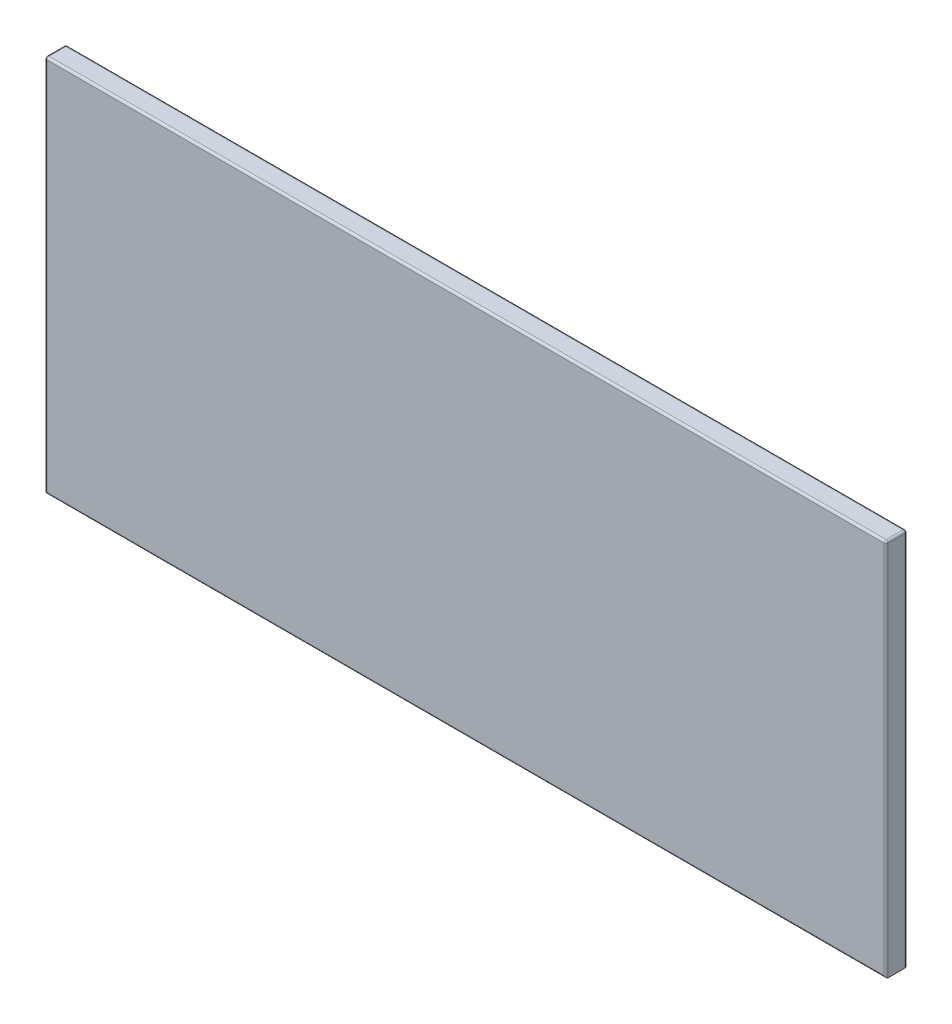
ISO-10303-21;
HEADER;
FILE_DESCRIPTION(('STEP AP214'),'2;1');
FILE_NAME('part.step','',(''),(''),'','','');
FILE_SCHEMA(('AUTOMOTIVE_DESIGN { 1 0 10303 214 1 1 1 1 }'));
ENDSEC;
DATA;
#1=APPLICATION_CONTEXT('core data for automotive mechanical design processes');
#2=APPLICATION_PROTOCOL_DEFINITION('international standard','automotive_design',2000,#1);
#3=PRODUCT_CONTEXT('',#1,'mechanical');
#4=PRODUCT('Part','Part','',(#3));
#5=PRODUCT_RELATED_PRODUCT_CATEGORY('part','',(#4));
#6=PRODUCT_DEFINITION_FORMATION('','',#4);
#7=PRODUCT_DEFINITION_CONTEXT('part definition',#1,'design');
#8=PRODUCT_DEFINITION('design','',#6,#7);
#9=PRODUCT_DEFINITION_SHAPE('','',#8);
#10=(LENGTH_UNIT() NAMED_UNIT(*) SI_UNIT(.MILLI.,.METRE.));
#11=(NAMED_UNIT(*) PLANE_ANGLE_UNIT() SI_UNIT($,.RADIAN.));
#12=(NAMED_UNIT(*) SI_UNIT($,.STERADIAN.) SOLID_ANGLE_UNIT());
#13=UNCERTAINTY_MEASURE_WITH_UNIT(LENGTH_MEASURE(1.E-05),#10,'distance_accuracy_value','');
#14=(GEOMETRIC_REPRESENTATION_CONTEXT(3) GLOBAL_UNCERTAINTY_ASSIGNED_CONTEXT((#13)) GLOBAL_UNIT_ASSIGNED_CONTEXT((#10,
#11,#12)) REPRESENTATION_CONTEXT('',''));
#15=CARTESIAN_POINT('',(0.,0.,0.));
#16=DIRECTION('',(0.,0.,1.));
#17=DIRECTION('',(1.,0.,0.));
#18=AXIS2_PLACEMENT_3D('',#15,#16,#17);
#19=CARTESIAN_POINT('',(-464.655290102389,-37.0452787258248,25.4));
#20=DIRECTION('',(1.,0.,0.));
#21=DIRECTION('',(0.,0.,-1.));
#22=AXIS2_PLACEMENT_3D('',#19,#20,#21);
#23=PLANE('',#22);
#24=DIRECTION('',(0.,0.,-1.));
#25=VECTOR('',#24,1.);
#26=CARTESIAN_POINT('',(-464.655290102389,417.614721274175,25.4));
#27=LINE('',#26,#25);
#28=CARTESIAN_POINT('',(-464.655290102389,417.614721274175,22.86));
#29=VERTEX_POINT('',#28);
#30=CARTESIAN_POINT('',(-464.655290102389,417.614721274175,2.54));
#31=VERTEX_POINT('',#30);
#32=EDGE_CURVE('E203',#29,#31,#27,.T.);
#33=ORIENTED_EDGE('',*,*,#32,.T.);
#34=DIRECTION('',(0.,-1.,0.));
#35=VECTOR('',#34,1.);
#36=CARTESIAN_POINT('',(-464.655290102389,-37.0452787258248,2.54));
#37=LINE('',#36,#35);
#38=CARTESIAN_POINT('',(-464.655290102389,-37.0452787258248,2.54));
#39=VERTEX_POINT('',#38);
#40=EDGE_CURVE('E199',#31,#39,#37,.T.);
#41=ORIENTED_EDGE('',*,*,#40,.T.);
#42=DIRECTION('',(0.,0.,-1.));
#43=VECTOR('',#42,1.);
#44=CARTESIAN_POINT('',(-464.655290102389,-37.0452787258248,25.4));
#45=LINE('',#44,#43);
#46=CARTESIAN_POINT('',(-464.655290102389,-37.0452787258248,22.86));
#47=VERTEX_POINT('',#46);
#48=EDGE_CURVE('E136',#47,#39,#45,.T.);
#49=ORIENTED_EDGE('',*,*,#48,.F.);
#50=DIRECTION('',(0.,-1.,0.));
#51=VECTOR('',#50,1.);
#52=CARTESIAN_POINT('',(-464.655290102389,-37.0452787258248,22.86));
#53=LINE('',#52,#51);
#54=EDGE_CURVE('E201',#47,#29,#53,.F.);
#55=ORIENTED_EDGE('',*,*,#54,.T.);
#56=EDGE_LOOP('',(#33,#41,#49,#55));
#57=FACE_BOUND('',#56,.T.);
#58=ADVANCED_FACE('F39',(#57),#23,.F.);
#59=CARTESIAN_POINT('',(-464.655290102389,-37.0452787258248,25.4));
#60=DIRECTION('',(0.,1.,0.));
#61=DIRECTION('',(0.,0.,1.));
#62=AXIS2_PLACEMENT_3D('',#59,#60,#61);
#63=PLANE('',#62);
#64=ORIENTED_EDGE('',*,*,#48,.T.);
#65=DIRECTION('',(1.,0.,0.));
#66=VECTOR('',#65,1.);
#67=CARTESIAN_POINT('',(551.344709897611,-37.0452787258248,2.54));
#68=LINE('',#67,#66);
#69=CARTESIAN_POINT('',(551.344709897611,-37.0452787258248,2.54));
#70=VERTEX_POINT('',#69);
#71=EDGE_CURVE('E135',#39,#70,#68,.T.);
#72=ORIENTED_EDGE('',*,*,#71,.T.);
#73=DIRECTION('',(0.,0.,-1.));
#74=VECTOR('',#73,1.);
#75=CARTESIAN_POINT('',(551.344709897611,-37.0452787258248,25.4));
#76=LINE('',#75,#74);
#77=CARTESIAN_POINT('',(551.344709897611,-37.0452787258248,22.86));
#78=VERTEX_POINT('',#77);
#79=EDGE_CURVE('E118',#78,#70,#76,.T.);
#80=ORIENTED_EDGE('',*,*,#79,.F.);
#81=DIRECTION('',(1.,0.,0.));
#82=VECTOR('',#81,1.);
#83=CARTESIAN_POINT('',(-464.655290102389,-37.0452787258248,22.86));
#84=LINE('',#83,#82);
#85=EDGE_CURVE('E132',#78,#47,#84,.F.);
#86=ORIENTED_EDGE('',*,*,#85,.T.);
#87=EDGE_LOOP('',(#64,#72,#80,#86));
#88=FACE_BOUND('',#87,.T.);
#89=ADVANCED_FACE('F131',(#88),#63,.F.);
#90=CARTESIAN_POINT('',(551.344709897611,-37.0452787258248,25.4));
#91=DIRECTION('',(-1.,0.,0.));
#92=DIRECTION('',(0.,0.,1.));
#93=AXIS2_PLACEMENT_3D('',#90,#91,#92);
#94=PLANE('',#93);
#95=ORIENTED_EDGE('',*,*,#79,.T.);
#96=DIRECTION('',(0.,1.,0.));
#97=VECTOR('',#96,1.);
#98=CARTESIAN_POINT('',(551.344709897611,420.154721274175,2.54));
#99=LINE('',#98,#97);
#100=CARTESIAN_POINT('',(551.344709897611,417.614721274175,2.54));
#101=VERTEX_POINT('',#100);
#102=EDGE_CURVE('E125',#70,#101,#99,.T.);
#103=ORIENTED_EDGE('',*,*,#102,.T.);
#104=DIRECTION('',(0.,0.,-1.));
#105=VECTOR('',#104,1.);
#106=CARTESIAN_POINT('',(551.344709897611,417.614721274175,25.4));
#107=LINE('',#106,#105);
#108=CARTESIAN_POINT('',(551.344709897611,417.614721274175,22.86));
#109=VERTEX_POINT('',#108);
#110=EDGE_CURVE('E120',#101,#109,#107,.F.);
#111=ORIENTED_EDGE('',*,*,#110,.T.);
#112=DIRECTION('',(0.,1.,0.));
#113=VECTOR('',#112,1.);
#114=CARTESIAN_POINT('',(551.344709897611,-37.0452787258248,22.86));
#115=LINE('',#114,#113);
#116=EDGE_CURVE('E115',#109,#78,#115,.F.);
#117=ORIENTED_EDGE('',*,*,#116,.T.);
#118=EDGE_LOOP('',(#95,#103,#111,#117));
#119=FACE_BOUND('',#118,.T.);
#120=ADVANCED_FACE('F117',(#119),#94,.F.);
#121=CARTESIAN_POINT('',(-464.655290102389,420.154721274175,25.4));
#122=DIRECTION('',(0.,-1.,0.));
#123=DIRECTION('',(0.,0.,-1.));
#124=AXIS2_PLACEMENT_3D('',#121,#122,#123);
#125=PLANE('',#124);
#126=DIRECTION('',(-1.,0.,0.));
#127=VECTOR('',#126,1.);
#128=CARTESIAN_POINT('',(-464.655290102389,420.154721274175,22.86));
#129=LINE('',#128,#127);
#130=CARTESIAN_POINT('',(-462.115290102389,420.154721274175,22.86));
#131=VERTEX_POINT('',#130);
#132=CARTESIAN_POINT('',(548.804709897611,420.154721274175,22.86));
#133=VERTEX_POINT('',#132);
#134=EDGE_CURVE('E48',#131,#133,#129,.F.);
#135=ORIENTED_EDGE('',*,*,#134,.T.);
#136=DIRECTION('',(0.,0.,-1.));
#137=VECTOR('',#136,1.);
#138=CARTESIAN_POINT('',(548.804709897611,420.154721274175,25.4));
#139=LINE('',#138,#137);
#140=CARTESIAN_POINT('',(548.804709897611,420.154721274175,2.54));
#141=VERTEX_POINT('',#140);
#142=EDGE_CURVE('E11',#133,#141,#139,.T.);
#143=ORIENTED_EDGE('',*,*,#142,.T.);
#144=DIRECTION('',(-1.,0.,0.));
#145=VECTOR('',#144,1.);
#146=CARTESIAN_POINT('',(-464.655290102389,420.154721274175,2.54));
#147=LINE('',#146,#145);
#148=CARTESIAN_POINT('',(-462.115290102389,420.154721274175,2.54));
#149=VERTEX_POINT('',#148);
#150=EDGE_CURVE('E190',#141,#149,#147,.T.);
#151=ORIENTED_EDGE('',*,*,#150,.T.);
#152=DIRECTION('',(0.,0.,-1.));
#153=VECTOR('',#152,1.);
#154=CARTESIAN_POINT('',(-462.115290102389,420.154721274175,25.4));
#155=LINE('',#154,#153);
#156=EDGE_CURVE('E59',#149,#131,#155,.F.);
#157=ORIENTED_EDGE('',*,*,#156,.T.);
#158=EDGE_LOOP('',(#135,#143,#151,#157));
#159=FACE_BOUND('',#158,.T.);
#160=ADVANCED_FACE('F245',(#159),#125,.F.);
#161=CARTESIAN_POINT('',(0.,0.,25.4));
#162=DIRECTION('',(0.,0.,-1.));
#163=DIRECTION('',(-1.,0.,0.));
#164=AXIS2_PLACEMENT_3D('',#161,#162,#163);
#165=PLANE('',#164);
#166=DIRECTION('',(1.,0.,0.));
#167=VECTOR('',#166,1.);
#168=CARTESIAN_POINT('',(0.,-34.5052787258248,25.4));
#169=LINE('',#168,#167);
#170=CARTESIAN_POINT('',(-462.115290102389,-34.5052787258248,25.4));
#171=VERTEX_POINT('',#170);
#172=CARTESIAN_POINT('',(548.804709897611,-34.5052787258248,25.4));
#173=VERTEX_POINT('',#172);
#174=EDGE_CURVE('E193',#171,#173,#169,.T.);
#175=ORIENTED_EDGE('',*,*,#174,.T.);
#176=DIRECTION('',(0.,1.,0.));
#177=VECTOR('',#176,1.);
#178=CARTESIAN_POINT('',(548.804709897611,0.,25.4));
#179=LINE('',#178,#177);
#180=CARTESIAN_POINT('',(548.804709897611,417.614721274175,25.4));
#181=VERTEX_POINT('',#180);
#182=EDGE_CURVE('E149',#173,#181,#179,.T.);
#183=ORIENTED_EDGE('',*,*,#182,.T.);
#184=DIRECTION('',(-1.,0.,0.));
#185=VECTOR('',#184,1.);
#186=CARTESIAN_POINT('',(0.,417.614721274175,25.4));
#187=LINE('',#186,#185);
#188=CARTESIAN_POINT('',(-462.115290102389,417.614721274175,25.4));
#189=VERTEX_POINT('',#188);
#190=EDGE_CURVE('E197',#181,#189,#187,.T.);
#191=ORIENTED_EDGE('',*,*,#190,.T.);
#192=DIRECTION('',(0.,-1.,0.));
#193=VECTOR('',#192,1.);
#194=CARTESIAN_POINT('',(-462.115290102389,0.,25.4));
#195=LINE('',#194,#193);
#196=EDGE_CURVE('E195',#189,#171,#195,.T.);
#197=ORIENTED_EDGE('',*,*,#196,.T.);
#198=EDGE_LOOP('',(#175,#183,#191,#197));
#199=FACE_BOUND('',#198,.T.);
#200=ADVANCED_FACE('F247',(#199),#165,.F.);
#201=CARTESIAN_POINT('',(0.,0.,0.));
#202=DIRECTION('',(0.,0.,-1.));
#203=DIRECTION('',(-1.,0.,0.));
#204=AXIS2_PLACEMENT_3D('',#201,#202,#203);
#205=PLANE('',#204);
#206=DIRECTION('',(0.,1.,0.));
#207=VECTOR('',#206,1.);
#208=CARTESIAN_POINT('',(548.804709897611,-37.0452787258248,0.));
#209=LINE('',#208,#207);
#210=CARTESIAN_POINT('',(548.804709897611,417.614721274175,0.));
#211=VERTEX_POINT('',#210);
#212=CARTESIAN_POINT('',(548.804709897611,-34.5052787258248,0.));
#213=VERTEX_POINT('',#212);
#214=EDGE_CURVE('E210',#211,#213,#209,.F.);
#215=ORIENTED_EDGE('',*,*,#214,.T.);
#216=DIRECTION('',(1.,0.,0.));
#217=VECTOR('',#216,1.);
#218=CARTESIAN_POINT('',(-464.655290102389,-34.5052787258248,0.));
#219=LINE('',#218,#217);
#220=CARTESIAN_POINT('',(-462.115290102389,-34.5052787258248,0.));
#221=VERTEX_POINT('',#220);
#222=EDGE_CURVE('E207',#213,#221,#219,.F.);
#223=ORIENTED_EDGE('',*,*,#222,.T.);
#224=DIRECTION('',(0.,-1.,0.));
#225=VECTOR('',#224,1.);
#226=CARTESIAN_POINT('',(-462.115290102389,420.154721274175,0.));
#227=LINE('',#226,#225);
#228=CARTESIAN_POINT('',(-462.115290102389,417.614721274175,0.));
#229=VERTEX_POINT('',#228);
#230=EDGE_CURVE('E212',#221,#229,#227,.F.);
#231=ORIENTED_EDGE('',*,*,#230,.T.);
#232=DIRECTION('',(-1.,0.,0.));
#233=VECTOR('',#232,1.);
#234=CARTESIAN_POINT('',(551.344709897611,417.614721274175,0.));
#235=LINE('',#234,#233);
#236=EDGE_CURVE('E214',#229,#211,#235,.F.);
#237=ORIENTED_EDGE('',*,*,#236,.T.);
#238=EDGE_LOOP('',(#215,#223,#231,#237));
#239=FACE_BOUND('',#238,.T.);
#240=ADVANCED_FACE('F253',(#239),#205,.T.);
#241=CARTESIAN_POINT('',(0.,-34.5052787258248,22.86));
#242=DIRECTION('',(1.,0.,0.));
#243=DIRECTION('',(0.,0.,-1.));
#244=AXIS2_PLACEMENT_3D('',#241,#242,#243);
#245=CYLINDRICAL_SURFACE('',#244,2.54);
#246=CARTESIAN_POINT('',(548.804709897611,-34.5052787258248,22.86));
#247=DIRECTION('',(0.707106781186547,0.707106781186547,0.));
#248=DIRECTION('',(0.707106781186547,-0.707106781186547,0.));
#249=AXIS2_PLACEMENT_3D('',#246,#247,#248);
#250=ELLIPSE('',#249,3.59210244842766,2.54);
#251=EDGE_CURVE('E142',#173,#78,#250,.T.);
#252=ORIENTED_EDGE('',*,*,#251,.F.);
#253=ORIENTED_EDGE('',*,*,#174,.F.);
#254=CARTESIAN_POINT('',(-462.115290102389,-34.5052787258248,22.86));
#255=DIRECTION('',(0.707106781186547,-0.707106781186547,0.));
#256=DIRECTION('',(-0.707106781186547,-0.707106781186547,0.));
#257=AXIS2_PLACEMENT_3D('',#254,#255,#256);
#258=ELLIPSE('',#257,3.59210244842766,2.54);
#259=EDGE_CURVE('E43',#47,#171,#258,.F.);
#260=ORIENTED_EDGE('',*,*,#259,.F.);
#261=ORIENTED_EDGE('',*,*,#85,.F.);
#262=EDGE_LOOP('',(#252,#253,#260,#261));
#263=FACE_BOUND('',#262,.T.);
#264=ADVANCED_FACE('F41',(#263),#245,.T.);
#265=CARTESIAN_POINT('',(-462.115290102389,0.,22.86));
#266=DIRECTION('',(0.,-1.,0.));
#267=DIRECTION('',(0.,0.,-1.));
#268=AXIS2_PLACEMENT_3D('',#265,#266,#267);
#269=CYLINDRICAL_SURFACE('',#268,2.54);
#270=ORIENTED_EDGE('',*,*,#259,.T.);
#271=ORIENTED_EDGE('',*,*,#196,.F.);
#272=CARTESIAN_POINT('',(-462.115290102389,417.614721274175,22.86));
#273=DIRECTION('',(0.,1.,0.));
#274=DIRECTION('',(0.,0.,1.));
#275=AXIS2_PLACEMENT_3D('',#272,#273,#274);
#276=CIRCLE('',#275,2.54);
#277=EDGE_CURVE('E152',#29,#189,#276,.T.);
#278=ORIENTED_EDGE('',*,*,#277,.F.);
#279=ORIENTED_EDGE('',*,*,#54,.F.);
#280=EDGE_LOOP('',(#270,#271,#278,#279));
#281=FACE_BOUND('',#280,.T.);
#282=ADVANCED_FACE('F298',(#281),#269,.T.);
#283=CARTESIAN_POINT('',(548.804709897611,0.,22.86));
#284=DIRECTION('',(0.,1.,0.));
#285=DIRECTION('',(0.,0.,1.));
#286=AXIS2_PLACEMENT_3D('',#283,#284,#285);
#287=CYLINDRICAL_SURFACE('',#286,2.54);
#288=ORIENTED_EDGE('',*,*,#251,.T.);
#289=ORIENTED_EDGE('',*,*,#116,.F.);
#290=CARTESIAN_POINT('',(548.804709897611,417.614721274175,22.86));
#291=DIRECTION('',(0.,1.,0.));
#292=DIRECTION('',(0.,0.,1.));
#293=AXIS2_PLACEMENT_3D('',#290,#291,#292);
#294=CIRCLE('',#293,2.54);
#295=EDGE_CURVE('E157',#181,#109,#294,.T.);
#296=ORIENTED_EDGE('',*,*,#295,.F.);
#297=ORIENTED_EDGE('',*,*,#182,.F.);
#298=EDGE_LOOP('',(#288,#289,#296,#297));
#299=FACE_BOUND('',#298,.T.);
#300=ADVANCED_FACE('F147',(#299),#287,.T.);
#301=CARTESIAN_POINT('',(0.,417.614721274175,22.86));
#302=DIRECTION('',(-1.,0.,0.));
#303=DIRECTION('',(0.,0.,1.));
#304=AXIS2_PLACEMENT_3D('',#301,#302,#303);
#305=CYLINDRICAL_SURFACE('',#304,2.54);
#306=CARTESIAN_POINT('',(-462.115290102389,417.614721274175,22.86));
#307=DIRECTION('',(-1.,0.,0.));
#308=DIRECTION('',(0.,0.,1.));
#309=AXIS2_PLACEMENT_3D('',#306,#307,#308);
#310=CIRCLE('',#309,2.54);
#311=EDGE_CURVE('E150',#189,#131,#310,.T.);
#312=ORIENTED_EDGE('',*,*,#311,.F.);
#313=ORIENTED_EDGE('',*,*,#190,.F.);
#314=CARTESIAN_POINT('',(548.804709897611,417.614721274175,22.86));
#315=DIRECTION('',(1.,0.,0.));
#316=DIRECTION('',(0.,0.,-1.));
#317=AXIS2_PLACEMENT_3D('',#314,#315,#316);
#318=CIRCLE('',#317,2.54);
#319=EDGE_CURVE('E159',#133,#181,#318,.T.);
#320=ORIENTED_EDGE('',*,*,#319,.F.);
#321=ORIENTED_EDGE('',*,*,#134,.F.);
#322=EDGE_LOOP('',(#312,#313,#320,#321));
#323=FACE_BOUND('',#322,.T.);
#324=ADVANCED_FACE('F292',(#323),#305,.T.);
#325=CARTESIAN_POINT('',(-462.115290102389,417.614721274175,22.86));
#326=DIRECTION('',(0.,0.,1.));
#327=DIRECTION('',(1.,0.,0.));
#328=AXIS2_PLACEMENT_3D('',#325,#326,#327);
#329=SPHERICAL_SURFACE('',#328,2.54);
#330=ORIENTED_EDGE('',*,*,#277,.T.);
#331=ORIENTED_EDGE('',*,*,#311,.T.);
#332=CARTESIAN_POINT('',(-462.115290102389,417.614721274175,22.86));
#333=DIRECTION('',(0.,0.,1.));
#334=DIRECTION('',(1.,0.,0.));
#335=AXIS2_PLACEMENT_3D('',#332,#333,#334);
#336=CIRCLE('',#335,2.54);
#337=EDGE_CURVE('E161',#29,#131,#336,.F.);
#338=ORIENTED_EDGE('',*,*,#337,.F.);
#339=EDGE_LOOP('',(#330,#331,#338));
#340=FACE_BOUND('',#339,.T.);
#341=ADVANCED_FACE('F288',(#340),#329,.T.);
#342=CARTESIAN_POINT('',(548.804709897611,417.614721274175,22.86));
#343=DIRECTION('',(0.,0.,1.));
#344=DIRECTION('',(1.,0.,0.));
#345=AXIS2_PLACEMENT_3D('',#342,#343,#344);
#346=SPHERICAL_SURFACE('',#345,2.54);
#347=ORIENTED_EDGE('',*,*,#319,.T.);
#348=ORIENTED_EDGE('',*,*,#295,.T.);
#349=CARTESIAN_POINT('',(548.804709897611,417.614721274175,22.86));
#350=DIRECTION('',(0.,0.,1.));
#351=DIRECTION('',(1.,0.,0.));
#352=AXIS2_PLACEMENT_3D('',#349,#350,#351);
#353=CIRCLE('',#352,2.54);
#354=EDGE_CURVE('E164',#133,#109,#353,.F.);
#355=ORIENTED_EDGE('',*,*,#354,.F.);
#356=EDGE_LOOP('',(#347,#348,#355));
#357=FACE_BOUND('',#356,.T.);
#358=ADVANCED_FACE('F284',(#357),#346,.T.);
#359=CARTESIAN_POINT('',(-462.115290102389,417.614721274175,25.4));
#360=DIRECTION('',(0.,0.,-1.));
#361=DIRECTION('',(-1.,0.,0.));
#362=AXIS2_PLACEMENT_3D('',#359,#360,#361);
#363=CYLINDRICAL_SURFACE('',#362,2.54);
#364=ORIENTED_EDGE('',*,*,#337,.T.);
#365=ORIENTED_EDGE('',*,*,#156,.F.);
#366=CARTESIAN_POINT('',(-462.115290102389,417.614721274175,2.54));
#367=DIRECTION('',(0.,0.,-1.));
#368=DIRECTION('',(-1.,0.,0.));
#369=AXIS2_PLACEMENT_3D('',#366,#367,#368);
#370=CIRCLE('',#369,2.54);
#371=EDGE_CURVE('E170',#31,#149,#370,.T.);
#372=ORIENTED_EDGE('',*,*,#371,.F.);
#373=ORIENTED_EDGE('',*,*,#32,.F.);
#374=EDGE_LOOP('',(#364,#365,#372,#373));
#375=FACE_BOUND('',#374,.T.);
#376=ADVANCED_FACE('F281',(#375),#363,.T.);
#377=CARTESIAN_POINT('',(548.804709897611,417.614721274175,25.4));
#378=DIRECTION('',(0.,0.,-1.));
#379=DIRECTION('',(-1.,0.,0.));
#380=AXIS2_PLACEMENT_3D('',#377,#378,#379);
#381=CYLINDRICAL_SURFACE('',#380,2.54);
#382=ORIENTED_EDGE('',*,*,#354,.T.);
#383=ORIENTED_EDGE('',*,*,#110,.F.);
#384=CARTESIAN_POINT('',(548.804709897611,417.614721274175,2.54));
#385=DIRECTION('',(0.,0.,-1.));
#386=DIRECTION('',(-1.,0.,0.));
#387=AXIS2_PLACEMENT_3D('',#384,#385,#386);
#388=CIRCLE('',#387,2.54);
#389=EDGE_CURVE('E173',#141,#101,#388,.T.);
#390=ORIENTED_EDGE('',*,*,#389,.F.);
#391=ORIENTED_EDGE('',*,*,#142,.F.);
#392=EDGE_LOOP('',(#382,#383,#390,#391));
#393=FACE_BOUND('',#392,.T.);
#394=ADVANCED_FACE('F234',(#393),#381,.T.);
#395=CARTESIAN_POINT('',(-464.655290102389,417.614721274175,2.54));
#396=DIRECTION('',(1.,0.,0.));
#397=DIRECTION('',(0.,0.,-1.));
#398=AXIS2_PLACEMENT_3D('',#395,#396,#397);
#399=CYLINDRICAL_SURFACE('',#398,2.54);
#400=CARTESIAN_POINT('',(-462.115290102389,417.614721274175,2.54));
#401=DIRECTION('',(-1.,0.,0.));
#402=DIRECTION('',(0.,0.,1.));
#403=AXIS2_PLACEMENT_3D('',#400,#401,#402);
#404=CIRCLE('',#403,2.54);
#405=EDGE_CURVE('E167',#149,#229,#404,.T.);
#406=ORIENTED_EDGE('',*,*,#405,.F.);
#407=ORIENTED_EDGE('',*,*,#150,.F.);
#408=CARTESIAN_POINT('',(548.804709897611,417.614721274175,2.54));
#409=DIRECTION('',(1.,0.,0.));
#410=DIRECTION('',(0.,0.,-1.));
#411=AXIS2_PLACEMENT_3D('',#408,#409,#410);
#412=CIRCLE('',#411,2.54);
#413=EDGE_CURVE('E176',#211,#141,#412,.T.);
#414=ORIENTED_EDGE('',*,*,#413,.F.);
#415=ORIENTED_EDGE('',*,*,#236,.F.);
#416=EDGE_LOOP('',(#406,#407,#414,#415));
#417=FACE_BOUND('',#416,.T.);
#418=ADVANCED_FACE('F244',(#417),#399,.T.);
#419=CARTESIAN_POINT('',(-462.115290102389,417.614721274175,2.54));
#420=DIRECTION('',(0.,1.,0.));
#421=DIRECTION('',(0.,0.,1.));
#422=AXIS2_PLACEMENT_3D('',#419,#420,#421);
#423=SPHERICAL_SURFACE('',#422,2.54);
#424=ORIENTED_EDGE('',*,*,#371,.T.);
#425=ORIENTED_EDGE('',*,*,#405,.T.);
#426=CARTESIAN_POINT('',(-462.115290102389,417.614721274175,2.54));
#427=DIRECTION('',(0.,1.,0.));
#428=DIRECTION('',(0.,0.,1.));
#429=AXIS2_PLACEMENT_3D('',#426,#427,#428);
#430=CIRCLE('',#429,2.54);
#431=EDGE_CURVE('E178',#31,#229,#430,.F.);
#432=ORIENTED_EDGE('',*,*,#431,.F.);
#433=EDGE_LOOP('',(#424,#425,#432));
#434=FACE_BOUND('',#433,.T.);
#435=ADVANCED_FACE('F273',(#434),#423,.T.);
#436=CARTESIAN_POINT('',(548.804709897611,417.614721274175,2.54));
#437=DIRECTION('',(0.,1.,0.));
#438=DIRECTION('',(0.,0.,1.));
#439=AXIS2_PLACEMENT_3D('',#436,#437,#438);
#440=SPHERICAL_SURFACE('',#439,2.54);
#441=ORIENTED_EDGE('',*,*,#413,.T.);
#442=ORIENTED_EDGE('',*,*,#389,.T.);
#443=CARTESIAN_POINT('',(548.804709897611,417.614721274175,2.54));
#444=DIRECTION('',(0.,1.,0.));
#445=DIRECTION('',(0.,0.,1.));
#446=AXIS2_PLACEMENT_3D('',#443,#444,#445);
#447=CIRCLE('',#446,2.54);
#448=EDGE_CURVE('E181',#211,#101,#447,.F.);
#449=ORIENTED_EDGE('',*,*,#448,.F.);
#450=EDGE_LOOP('',(#441,#442,#449));
#451=FACE_BOUND('',#450,.T.);
#452=ADVANCED_FACE('F239',(#451),#440,.T.);
#453=CARTESIAN_POINT('',(-462.115290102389,-37.0452787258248,2.54));
#454=DIRECTION('',(0.,1.,0.));
#455=DIRECTION('',(0.,0.,1.));
#456=AXIS2_PLACEMENT_3D('',#453,#454,#455);
#457=CYLINDRICAL_SURFACE('',#456,2.54);
#458=ORIENTED_EDGE('',*,*,#431,.T.);
#459=ORIENTED_EDGE('',*,*,#230,.F.);
#460=CARTESIAN_POINT('',(-462.115290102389,-34.5052787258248,2.54));
#461=DIRECTION('',(-0.707106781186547,0.707106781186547,0.));
#462=DIRECTION('',(0.707106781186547,0.707106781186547,0.));
#463=AXIS2_PLACEMENT_3D('',#460,#461,#462);
#464=ELLIPSE('',#463,3.59210244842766,2.54);
#465=EDGE_CURVE('E184',#39,#221,#464,.F.);
#466=ORIENTED_EDGE('',*,*,#465,.F.);
#467=ORIENTED_EDGE('',*,*,#40,.F.);
#468=EDGE_LOOP('',(#458,#459,#466,#467));
#469=FACE_BOUND('',#468,.T.);
#470=ADVANCED_FACE('F222',(#469),#457,.T.);
#471=CARTESIAN_POINT('',(548.804709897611,-37.0452787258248,2.54));
#472=DIRECTION('',(0.,-1.,0.));
#473=DIRECTION('',(0.,0.,-1.));
#474=AXIS2_PLACEMENT_3D('',#471,#472,#473);
#475=CYLINDRICAL_SURFACE('',#474,2.54);
#476=ORIENTED_EDGE('',*,*,#448,.T.);
#477=ORIENTED_EDGE('',*,*,#102,.F.);
#478=CARTESIAN_POINT('',(548.804709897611,-34.5052787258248,2.54));
#479=DIRECTION('',(-0.707106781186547,-0.707106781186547,0.));
#480=DIRECTION('',(0.707106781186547,-0.707106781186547,0.));
#481=AXIS2_PLACEMENT_3D('',#478,#479,#480);
#482=ELLIPSE('',#481,3.59210244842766,2.54);
#483=EDGE_CURVE('E186',#213,#70,#482,.T.);
#484=ORIENTED_EDGE('',*,*,#483,.F.);
#485=ORIENTED_EDGE('',*,*,#214,.F.);
#486=EDGE_LOOP('',(#476,#477,#484,#485));
#487=FACE_BOUND('',#486,.T.);
#488=ADVANCED_FACE('F230',(#487),#475,.T.);
#489=CARTESIAN_POINT('',(-464.655290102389,-34.5052787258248,2.54));
#490=DIRECTION('',(-1.,0.,0.));
#491=DIRECTION('',(0.,0.,1.));
#492=AXIS2_PLACEMENT_3D('',#489,#490,#491);
#493=CYLINDRICAL_SURFACE('',#492,2.54);
#494=ORIENTED_EDGE('',*,*,#465,.T.);
#495=ORIENTED_EDGE('',*,*,#222,.F.);
#496=ORIENTED_EDGE('',*,*,#483,.T.);
#497=ORIENTED_EDGE('',*,*,#71,.F.);
#498=EDGE_LOOP('',(#494,#495,#496,#497));
#499=FACE_BOUND('',#498,.T.);
#500=ADVANCED_FACE('F225',(#499),#493,.T.);
#501=CLOSED_SHELL('',(#58,#89,#120,#160,#200,#240,#264,#282,#300,#324,#341,#358,#376,#394,#418,
#435,#452,#470,#488,#500));
#502=MANIFOLD_SOLID_BREP('B2',#501);
#503=ADVANCED_BREP_SHAPE_REPRESENTATION('',(#18,#502),#14);
#504=SHAPE_DEFINITION_REPRESENTATION(#9,#503);
ENDSEC;
END-ISO-10303-21;
